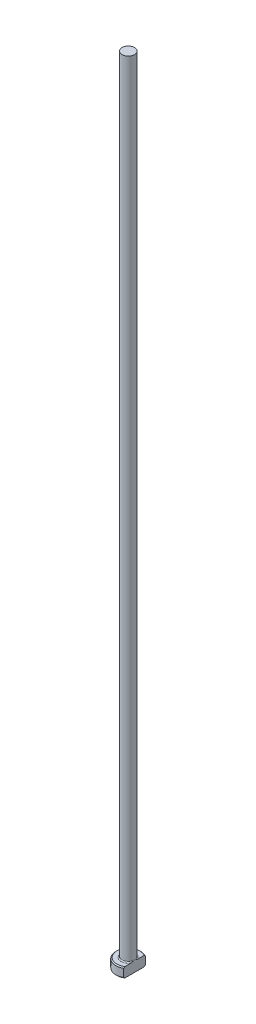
from build123d import *
from build123d.topology import SkipClean

# Parameters (mm, degrees)
CHAMFER1_SIZE = 0.2
FILLET1_R     = 0.2
KEY_DEPTH     = 161.039057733


with BuildPart() as part:
    # Sketch1 → Revolve1 (revolve)
    with BuildSketch(Plane.XY, mode=Mode.PRIVATE) as revolve1_sk:
        Polygon((0, 0), (-2.5, 0), (-2.5, 2), (-1.25, 2), (-1.25, 160), (0, 160), align=None)
    revolve(revolve1_sk.sketch.rotate(Axis((0, 259.958771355, 0), (0, -1, 0)), 270), axis=Axis((0, 259.958771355, 0), (0, -1, 0)))

    # Chamfer1
    chamfer1_edges = [part.edges().sort_by_distance(p)[0] for p in [
        (0, 2, -2.5),
        (0, 0, -2.5),
    ]]
    chamfer(chamfer1_edges, length=CHAMFER1_SIZE)

    # Fillet1
    fillet1_edges = [part.edges().sort_by_distance(p)[0] for p in [
        (0, 2, -1.25),
    ]]
    fillet(fillet1_edges, radius=FILLET1_R)

    # Sketch2 → KEY (cut, through all)
    with SkipClean():  # the faces are left unmerged after this step: merging them gives an invalid solid
        with BuildSketch(Plane(origin=(0, 0, 0), x_dir=(1, 0, 0), z_dir=(0, 1, 0))):
            with BuildLine():
                Line((1.25, 2.165063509), (1.25, -2.165063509))
                ThreePointArc((1.25, -2.165063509), (2.5, 0), (1.25, 2.165063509))
            make_face()
        extrude(amount=KEY_DEPTH, mode=Mode.SUBTRACT)


solid = part.part
